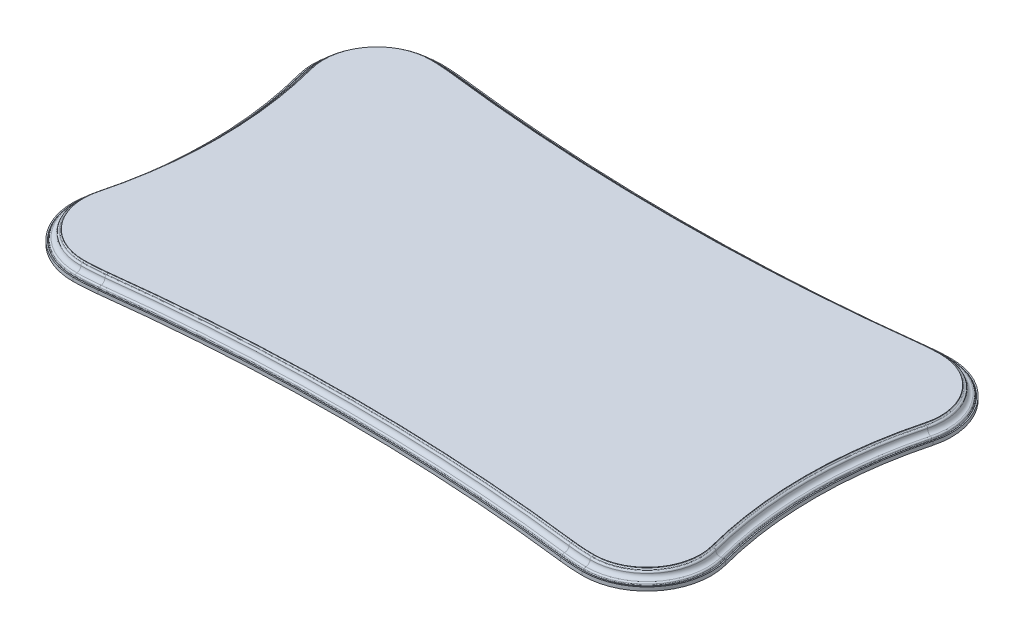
from build123d import *

# Parameters (mm, degrees)
CROQUIS1_W            = 1250
CROQUIS1_H            = 25
EXTRUIR1_DEPTH        = 365
CROQUIS2_W            = 1250
CROQUIS2_H            = 730
CORTAR_EXTRUIR1_DEPTH = 725.206462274


with BuildPart() as part:
    # Croquis1 → Extruir1 (new, symmetric)
    with BuildSketch(Plane.XY):
        Rectangle(CROQUIS1_W, CROQUIS1_H)
    extrude(amount=EXTRUIR1_DEPTH, both=True)

    # Croquis2 → Cortar-Extruir1 (cut, through all)
    with BuildSketch(Plane(origin=(0, 12.5, 0), x_dir=(1, 0, 0), z_dir=(0, 1, 0))):
        Rectangle(CROQUIS2_W, CROQUIS2_H)
        with BuildLine():
            ThreePointArc((-445, 351.990016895), (0, 325), (445, 351.990016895))
            ThreePointArc((445, 351.990016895), (467.459052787, 354.104534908), (490, 354.991065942))
            ThreePointArc((490, 354.991065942), (588.86890209, 307.461224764), (610.919543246, 200))
            ThreePointArc((610.919543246, 200), (585, 0), (610.919543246, -200))
            ThreePointArc((610.919543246, -200), (588.86890209, -307.461224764), (490, -354.991065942))
            ThreePointArc((490, -354.991065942), (467.459052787, -354.104534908), (445, -351.990016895))
            ThreePointArc((445, -351.990016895), (0, -325), (-445, -351.990016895))
            ThreePointArc((-445, -351.990016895), (-467.459052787, -354.104534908), (-490, -354.991065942))
            ThreePointArc((-490, -354.991065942), (-588.86890209, -307.461224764), (-610.919543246, -200))
            ThreePointArc((-610.919543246, -200), (-585, 0), (-610.919543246, 200))
            ThreePointArc((-610.919543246, 200), (-588.86890209, 307.461224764), (-490, 354.991065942))
            ThreePointArc((-490, 354.991065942), (-467.459052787, 354.104534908), (-445, 351.990016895))
        make_face(mode=Mode.SUBTRACT)
    extrude(amount=-CORTAR_EXTRUIR1_DEPTH, mode=Mode.SUBTRACT)

    # Cortar-Barrer1: sweep along a path in Croquis4
    with BuildLine(Plane(origin=(0, 12.5, 0), x_dir=(1, 0, 0), z_dir=(0, 1, 0))) as cortar_barrer1_path:
        ThreePointArc((-445, 351.990016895), (-467.459052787, 354.104534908), (-490, 354.991065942))
        ThreePointArc((-490, 354.991065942), (-588.86890209, 307.461224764), (-610.919543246, 200))
        ThreePointArc((-610.919543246, 200), (-585, 0), (-610.919543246, -200))
        ThreePointArc((-610.919543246, -200), (-588.86890209, -307.461224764), (-490, -354.991065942))
        ThreePointArc((-490, -354.991065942), (-467.459052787, -354.104534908), (-445, -351.990016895))
        ThreePointArc((-445, -351.990016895), (0, -325), (445, -351.990016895))
        ThreePointArc((445, -351.990016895), (467.459052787, -354.104534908), (490, -354.991065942))
        ThreePointArc((490, -354.991065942), (588.86890209, -307.461224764), (610.919543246, -200))
        ThreePointArc((610.919543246, -200), (585, 0), (610.919543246, 200))
        ThreePointArc((610.919543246, 200), (588.86890209, 307.461224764), (490, 354.991065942))
        ThreePointArc((490, 354.991065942), (467.459052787, 354.104534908), (445, 351.990016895))
        ThreePointArc((445, 351.990016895), (0, 325), (-445, 351.990016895))
    # Croquis3 → Cortar-Barrer1 (sweep, cut)
    with BuildSketch(Plane.XY):
        with BuildLine():
            Line((-589, 14.5), (-564, 14.5))
            Line((-564, 14.5), (-564, 11.5))
            ThreePointArc((-564, 11.5), (-564.585786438, 10.085786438), (-566, 9.5))
            Line((-566, 9.5), (-567, 9.5))
            ThreePointArc((-567, 9.5), (-569.121320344, 8.621320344), (-570, 6.5))
            ThreePointArc((-570, 6.5), (-572.343145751, 0.843145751), (-578, -1.5))
            ThreePointArc((-578, -1.5), (-579.838162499, -2.129101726), (-580.905397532, -3.752560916))
            ThreePointArc((-580.905397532, -3.752560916), (-581.24955438, -4.463841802), (-581.842329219, -4.986319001))
            Line((-581.842329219, -4.986319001), (-582.732050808, -5.5))
            Line((-582.732050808, -5.5), (-589, -5.5))
            Line((-589, -5.5), (-589, 14.5))
        make_face()
    sweep(path=cortar_barrer1_path.line, mode=Mode.SUBTRACT)


solid = part.part
